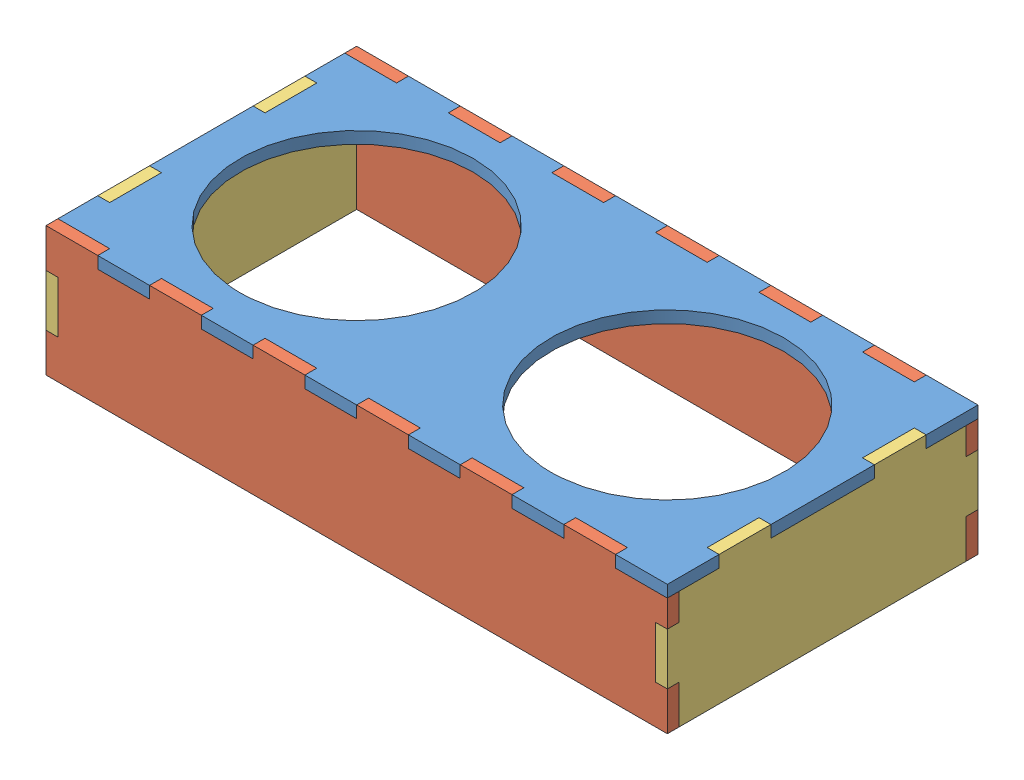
SolidWorks assembly Assem1.sldasm, configuration Default (file format 8000). Lengths in mm.
Overall size (304.8 63.5 152.4).
5 component instances, 3 part files, 9 mates.
Components (placement in the parent):
- dish top-1: dish top.SLDPRT [Default] at (188.0498 183.8832 216.1271) size (304.8 5.84 152.4)
- dish front-1: dish front.SLDPRT [Default] at (264.2498 126.2252 286.4851) size (304.8 63.5 5.84)
- dish front-2: dish front.SLDPRT [Default] at (264.2498 126.2252 139.9271) size (304.8 63.5 5.84)
- dish side-1: dish side.SLDPRT [Default] at (258.4078 130.4515 292.3271) size (5.84 63.5 152.4)
- dish side-2: dish side.SLDPRT [Default] at (-40.5502 130.4515 292.3271) size (5.84 63.5 152.4)
Mates (geometry in assembly coordinates):
- Coincident1: coincident aligned: plane of dish top-1 through (188.0498 189.7252 216.1271) normal (0 1 0); plane of dish front-1 through (-15.1502 189.7252 292.3271) normal (0 1 0)
- Coincident2: coincident anti-aligned: plane of dish top-1 through (-15.1502 189.7252 286.4851) normal (-1 0 0); plane of dish front-1 through (-15.1502 189.7252 292.3271) normal (1 0 0)
- Coincident3: coincident anti-aligned: plane of dish top-1 through (-40.5502 189.7252 286.4851) normal (0 0 1); plane of dish front-1 through (264.2498 126.2252 286.4851) normal (0 0 -1)
- Coincident4: coincident aligned: plane of dish top-1 through (188.0498 189.7252 216.1271) normal (0 1 0); plane of dish front-2 through (137.2498 189.7252 145.7691) normal (0 1 0)
- Coincident5: coincident aligned: plane of dish top-1 through (-40.5502 189.7252 145.7691) normal (-1 0 0); plane of dish front-2 through (-40.5502 170.6752 145.7691) normal (-1 0 0)
- Coincident6: coincident anti-aligned: plane of dish top-1 through (-40.5502 189.7252 145.7691) normal (0 0 -1); plane of dish front-2 through (264.2498 126.2252 145.7691) normal (0 0 1)
- Coincident8: coincident aligned: plane of dish front-1 through (264.2498 126.2252 292.3271) normal (0 0 1); plane of dish side-1 through (264.2498 130.4515 292.3271) normal (0 0 1)
- Coincident9: coincident aligned: plane of dish front-1 through (264.2498 170.6752 292.3271) normal (1 0 0); plane of dish side-1 through (264.2498 130.4515 292.3271) normal (1 0 0)
- Coincident10: coincident aligned: plane of dish top-1 through (188.0498 189.7252 216.1271) normal (0 1 0); plane of dish side-1 through (264.2498 189.7252 292.3271) normal (0 1 0)
